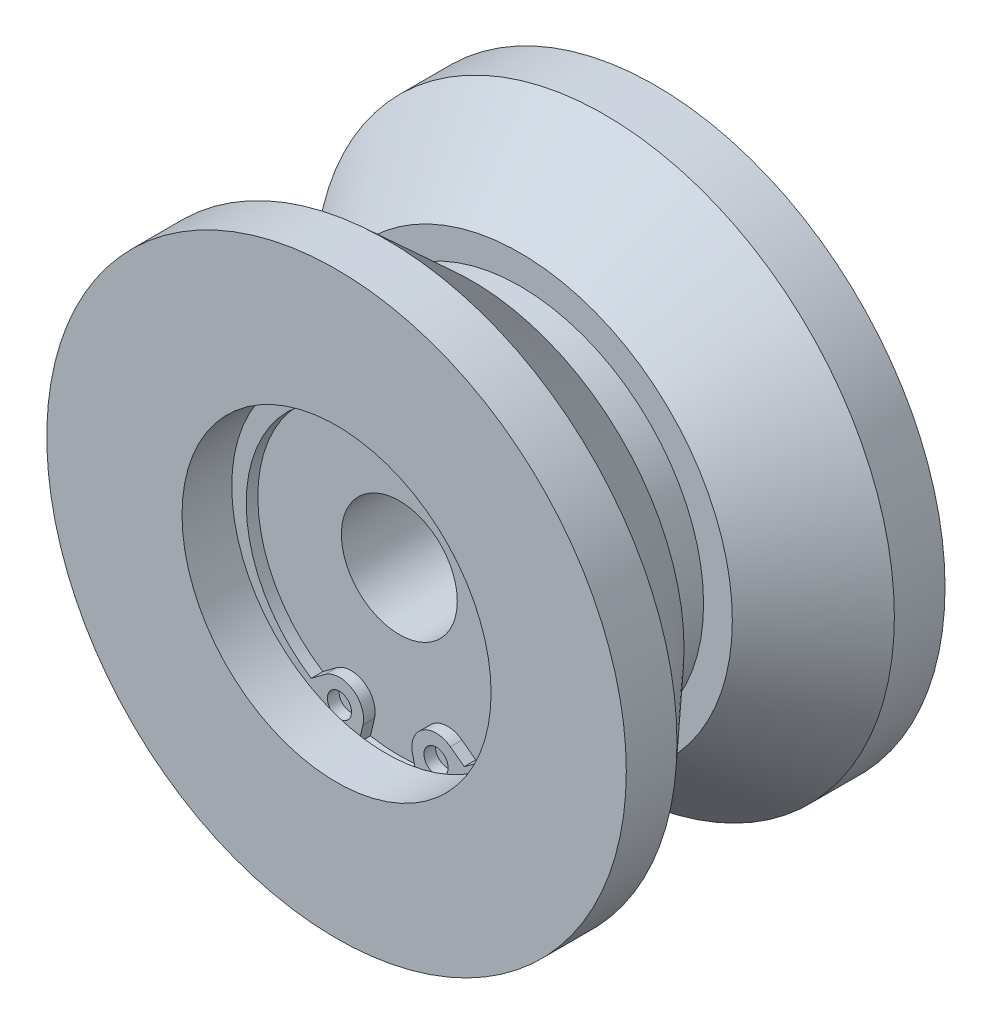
ISO-10303-21;
HEADER;
FILE_DESCRIPTION(('STEP AP214'),'2;1');
FILE_NAME('part.step','',(''),(''),'','','');
FILE_SCHEMA(('AUTOMOTIVE_DESIGN { 1 0 10303 214 1 1 1 1 }'));
ENDSEC;
DATA;
#1=APPLICATION_CONTEXT('core data for automotive mechanical design processes');
#2=APPLICATION_PROTOCOL_DEFINITION('international standard','automotive_design',2000,#1);
#3=PRODUCT_CONTEXT('',#1,'mechanical');
#4=PRODUCT('Part','Part','',(#3));
#5=PRODUCT_RELATED_PRODUCT_CATEGORY('part','',(#4));
#6=PRODUCT_DEFINITION_FORMATION('','',#4);
#7=PRODUCT_DEFINITION_CONTEXT('part definition',#1,'design');
#8=PRODUCT_DEFINITION('design','',#6,#7);
#9=PRODUCT_DEFINITION_SHAPE('','',#8);
#10=(LENGTH_UNIT() NAMED_UNIT(*) SI_UNIT(.MILLI.,.METRE.));
#11=(NAMED_UNIT(*) PLANE_ANGLE_UNIT() SI_UNIT($,.RADIAN.));
#12=(NAMED_UNIT(*) SI_UNIT($,.STERADIAN.) SOLID_ANGLE_UNIT());
#13=UNCERTAINTY_MEASURE_WITH_UNIT(LENGTH_MEASURE(1.E-05),#10,'distance_accuracy_value','');
#14=(GEOMETRIC_REPRESENTATION_CONTEXT(3) GLOBAL_UNCERTAINTY_ASSIGNED_CONTEXT((#13)) GLOBAL_UNIT_ASSIGNED_CONTEXT((#10,
#11,#12)) REPRESENTATION_CONTEXT('',''));
#15=CARTESIAN_POINT('',(0.,0.,0.));
#16=DIRECTION('',(0.,0.,1.));
#17=DIRECTION('',(1.,0.,0.));
#18=AXIS2_PLACEMENT_3D('',#15,#16,#17);
#19=CARTESIAN_POINT('',(0.,16.,10.));
#20=DIRECTION('',(0.,0.,-1.));
#21=DIRECTION('',(-1.,0.,0.));
#22=AXIS2_PLACEMENT_3D('',#19,#20,#21);
#23=PLANE('',#22);
#24=CARTESIAN_POINT('',(5.,-14.2233767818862,10.));
#25=DIRECTION('',(0.,0.,1.));
#26=DIRECTION('',(1.,0.,0.));
#27=AXIS2_PLACEMENT_3D('',#24,#25,#26);
#28=CIRCLE('',#27,1.25);
#29=CARTESIAN_POINT('',(6.25,-14.2233767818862,10.));
#30=VERTEX_POINT('',#29);
#31=EDGE_CURVE('E117',#30,#30,#28,.T.);
#32=ORIENTED_EDGE('',*,*,#31,.T.);
#33=EDGE_LOOP('',(#32));
#34=FACE_BOUND('',#33,.T.);
#35=ADVANCED_FACE('F14',(#34),#23,.F.);
#36=CARTESIAN_POINT('',(-5.,-14.2233767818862,10.));
#37=DIRECTION('',(0.,0.,-1.));
#38=DIRECTION('',(1.,0.,0.));
#39=AXIS2_PLACEMENT_3D('',#36,#37,#38);
#40=CIRCLE('',#39,1.25);
#41=CARTESIAN_POINT('',(-3.75,-14.2233767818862,10.));
#42=VERTEX_POINT('',#41);
#43=EDGE_CURVE('E143',#42,#42,#40,.T.);
#44=ORIENTED_EDGE('',*,*,#43,.F.);
#45=EDGE_LOOP('',(#44));
#46=FACE_BOUND('',#45,.T.);
#47=ADVANCED_FACE('F249',(#46),#23,.F.);
#48=CARTESIAN_POINT('',(0.,0.,21.5));
#49=DIRECTION('',(0.,0.,1.));
#50=DIRECTION('',(1.,0.,0.));
#51=AXIS2_PLACEMENT_3D('',#48,#49,#50);
#52=CYLINDRICAL_SURFACE('',#51,19.);
#53=CARTESIAN_POINT('',(0.,0.,2.5));
#54=DIRECTION('',(0.,0.,1.));
#55=DIRECTION('',(1.,0.,0.));
#56=AXIS2_PLACEMENT_3D('',#53,#54,#55);
#57=CIRCLE('',#56,19.);
#58=CARTESIAN_POINT('',(19.,0.,2.5));
#59=VERTEX_POINT('',#58);
#60=EDGE_CURVE('E198',#59,#59,#57,.T.);
#61=ORIENTED_EDGE('',*,*,#60,.F.);
#62=EDGE_LOOP('',(#61));
#63=FACE_BOUND('',#62,.T.);
#64=CARTESIAN_POINT('',(0.,0.,-2.5));
#65=DIRECTION('',(0.,0.,1.));
#66=DIRECTION('',(1.,0.,0.));
#67=AXIS2_PLACEMENT_3D('',#64,#65,#66);
#68=CIRCLE('',#67,19.0000000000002);
#69=CARTESIAN_POINT('',(19.0000000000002,0.,-2.5));
#70=VERTEX_POINT('',#69);
#71=EDGE_CURVE('E195',#70,#70,#68,.T.);
#72=ORIENTED_EDGE('',*,*,#71,.T.);
#73=EDGE_LOOP('',(#72));
#74=FACE_BOUND('',#73,.T.);
#75=ADVANCED_FACE('F257',(#63,#74),#52,.T.);
#76=CARTESIAN_POINT('',(0.,21.9780763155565,-2.5));
#77=DIRECTION('',(0.,0.,-1.));
#78=DIRECTION('',(-1.,0.,0.));
#79=AXIS2_PLACEMENT_3D('',#76,#77,#78);
#80=PLANE('',#79);
#81=ORIENTED_EDGE('',*,*,#71,.F.);
#82=EDGE_LOOP('',(#81));
#83=FACE_BOUND('',#82,.T.);
#84=CARTESIAN_POINT('',(0.,0.,-2.5));
#85=DIRECTION('',(0.,0.,1.));
#86=DIRECTION('',(1.,0.,0.));
#87=AXIS2_PLACEMENT_3D('',#84,#85,#86);
#88=CIRCLE('',#87,21.9780763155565);
#89=CARTESIAN_POINT('',(21.9780763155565,0.,-2.5));
#90=VERTEX_POINT('',#89);
#91=EDGE_CURVE('E192',#90,#90,#88,.T.);
#92=ORIENTED_EDGE('',*,*,#91,.T.);
#93=EDGE_LOOP('',(#92));
#94=FACE_BOUND('',#93,.T.);
#95=ADVANCED_FACE('F493',(#83,#94),#80,.F.);
#96=CARTESIAN_POINT('',(0.,21.9780763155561,2.5));
#97=DIRECTION('',(0.,0.,1.));
#98=DIRECTION('',(1.,0.,0.));
#99=AXIS2_PLACEMENT_3D('',#96,#97,#98);
#100=PLANE('',#99);
#101=CARTESIAN_POINT('',(0.,0.,2.5));
#102=DIRECTION('',(0.,0.,1.));
#103=DIRECTION('',(1.,0.,0.));
#104=AXIS2_PLACEMENT_3D('',#101,#102,#103);
#105=CIRCLE('',#104,21.9780763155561);
#106=CARTESIAN_POINT('',(21.9780763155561,0.,2.5));
#107=VERTEX_POINT('',#106);
#108=EDGE_CURVE('E201',#107,#107,#105,.T.);
#109=ORIENTED_EDGE('',*,*,#108,.F.);
#110=EDGE_LOOP('',(#109));
#111=FACE_BOUND('',#110,.T.);
#112=ORIENTED_EDGE('',*,*,#60,.T.);
#113=EDGE_LOOP('',(#112));
#114=FACE_BOUND('',#113,.T.);
#115=ADVANCED_FACE('F483',(#111,#114),#100,.F.);
#116=CARTESIAN_POINT('',(0.,0.,-11.2543935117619));
#117=DIRECTION('',(0.,0.,-1.));
#118=DIRECTION('',(-1.,0.,0.));
#119=AXIS2_PLACEMENT_3D('',#116,#117,#118);
#120=CONICAL_SURFACE('',#119,30.,0.741764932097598);
#121=ORIENTED_EDGE('',*,*,#91,.F.);
#122=EDGE_LOOP('',(#121));
#123=FACE_BOUND('',#122,.T.);
#124=CARTESIAN_POINT('',(0.,0.,-11.2543935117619));
#125=DIRECTION('',(0.,0.,1.));
#126=DIRECTION('',(1.,0.,0.));
#127=AXIS2_PLACEMENT_3D('',#124,#125,#126);
#128=CIRCLE('',#127,30.);
#129=CARTESIAN_POINT('',(30.,0.,-11.2543935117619));
#130=VERTEX_POINT('',#129);
#131=EDGE_CURVE('E189',#130,#130,#128,.T.);
#132=ORIENTED_EDGE('',*,*,#131,.T.);
#133=EDGE_LOOP('',(#132));
#134=FACE_BOUND('',#133,.T.);
#135=ADVANCED_FACE('F473',(#123,#134),#120,.T.);
#136=CARTESIAN_POINT('',(0.,0.,2.5));
#137=DIRECTION('',(0.,0.,1.));
#138=DIRECTION('',(1.,0.,0.));
#139=AXIS2_PLACEMENT_3D('',#136,#137,#138);
#140=CONICAL_SURFACE('',#139,21.9780763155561,0.741764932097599);
#141=CARTESIAN_POINT('',(0.,0.,11.2543935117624));
#142=DIRECTION('',(0.,0.,1.));
#143=DIRECTION('',(1.,0.,0.));
#144=AXIS2_PLACEMENT_3D('',#141,#142,#143);
#145=CIRCLE('',#144,30.);
#146=CARTESIAN_POINT('',(30.,0.,11.2543935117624));
#147=VERTEX_POINT('',#146);
#148=EDGE_CURVE('E204',#147,#147,#145,.T.);
#149=ORIENTED_EDGE('',*,*,#148,.F.);
#150=EDGE_LOOP('',(#149));
#151=FACE_BOUND('',#150,.T.);
#152=ORIENTED_EDGE('',*,*,#108,.T.);
#153=EDGE_LOOP('',(#152));
#154=FACE_BOUND('',#153,.T.);
#155=ADVANCED_FACE('F463',(#151,#154),#140,.T.);
#156=CARTESIAN_POINT('',(0.,0.,21.5));
#157=DIRECTION('',(0.,0.,1.));
#158=DIRECTION('',(1.,0.,0.));
#159=AXIS2_PLACEMENT_3D('',#156,#157,#158);
#160=CYLINDRICAL_SURFACE('',#159,30.);
#161=ORIENTED_EDGE('',*,*,#131,.F.);
#162=EDGE_LOOP('',(#161));
#163=FACE_BOUND('',#162,.T.);
#164=CARTESIAN_POINT('',(0.,0.,-16.5));
#165=DIRECTION('',(0.,0.,1.));
#166=DIRECTION('',(1.,0.,0.));
#167=AXIS2_PLACEMENT_3D('',#164,#165,#166);
#168=CIRCLE('',#167,30.);
#169=CARTESIAN_POINT('',(30.,0.,-16.5));
#170=VERTEX_POINT('',#169);
#171=EDGE_CURVE('E186',#170,#170,#168,.T.);
#172=ORIENTED_EDGE('',*,*,#171,.T.);
#173=EDGE_LOOP('',(#172));
#174=FACE_BOUND('',#173,.T.);
#175=ADVANCED_FACE('F453',(#163,#174),#160,.T.);
#176=CARTESIAN_POINT('',(0.,0.,21.5));
#177=DIRECTION('',(0.,0.,1.));
#178=DIRECTION('',(1.,0.,0.));
#179=AXIS2_PLACEMENT_3D('',#176,#177,#178);
#180=CYLINDRICAL_SURFACE('',#179,30.);
#181=CARTESIAN_POINT('',(0.,0.,16.5));
#182=DIRECTION('',(0.,0.,1.));
#183=DIRECTION('',(1.,0.,0.));
#184=AXIS2_PLACEMENT_3D('',#181,#182,#183);
#185=CIRCLE('',#184,30.);
#186=CARTESIAN_POINT('',(30.,0.,16.5));
#187=VERTEX_POINT('',#186);
#188=EDGE_CURVE('E207',#187,#187,#185,.T.);
#189=ORIENTED_EDGE('',*,*,#188,.F.);
#190=EDGE_LOOP('',(#189));
#191=FACE_BOUND('',#190,.T.);
#192=ORIENTED_EDGE('',*,*,#148,.T.);
#193=EDGE_LOOP('',(#192));
#194=FACE_BOUND('',#193,.T.);
#195=ADVANCED_FACE('F444',(#191,#194),#180,.T.);
#196=CARTESIAN_POINT('',(0.,30.,-16.5));
#197=DIRECTION('',(0.,0.,1.));
#198=DIRECTION('',(1.,0.,0.));
#199=AXIS2_PLACEMENT_3D('',#196,#197,#198);
#200=PLANE('',#199);
#201=ORIENTED_EDGE('',*,*,#171,.F.);
#202=EDGE_LOOP('',(#201));
#203=FACE_BOUND('',#202,.T.);
#204=CARTESIAN_POINT('',(0.,0.,-16.5));
#205=DIRECTION('',(0.,0.,1.));
#206=DIRECTION('',(1.,0.,0.));
#207=AXIS2_PLACEMENT_3D('',#204,#205,#206);
#208=CIRCLE('',#207,13.);
#209=CARTESIAN_POINT('',(13.,0.,-16.5));
#210=VERTEX_POINT('',#209);
#211=EDGE_CURVE('E144',#210,#210,#208,.T.);
#212=ORIENTED_EDGE('',*,*,#211,.T.);
#213=EDGE_LOOP('',(#212));
#214=FACE_BOUND('',#213,.T.);
#215=ADVANCED_FACE('F16',(#203,#214),#200,.F.);
#216=CARTESIAN_POINT('',(0.,30.,16.5));
#217=DIRECTION('',(0.,0.,-1.));
#218=DIRECTION('',(-1.,0.,0.));
#219=AXIS2_PLACEMENT_3D('',#216,#217,#218);
#220=PLANE('',#219);
#221=CARTESIAN_POINT('',(0.,0.,16.5));
#222=DIRECTION('',(0.,0.,1.));
#223=DIRECTION('',(1.,0.,0.));
#224=AXIS2_PLACEMENT_3D('',#221,#222,#223);
#225=CIRCLE('',#224,16.);
#226=CARTESIAN_POINT('',(16.,0.,16.5));
#227=VERTEX_POINT('',#226);
#228=EDGE_CURVE('E210',#227,#227,#225,.T.);
#229=ORIENTED_EDGE('',*,*,#228,.F.);
#230=EDGE_LOOP('',(#229));
#231=FACE_BOUND('',#230,.T.);
#232=ORIENTED_EDGE('',*,*,#188,.T.);
#233=EDGE_LOOP('',(#232));
#234=FACE_BOUND('',#233,.T.);
#235=ADVANCED_FACE('F426',(#231,#234),#220,.F.);
#236=CARTESIAN_POINT('',(0.,0.,21.5));
#237=DIRECTION('',(0.,0.,1.));
#238=DIRECTION('',(1.,0.,0.));
#239=AXIS2_PLACEMENT_3D('',#236,#237,#238);
#240=CYLINDRICAL_SURFACE('',#239,13.);
#241=ORIENTED_EDGE('',*,*,#211,.F.);
#242=EDGE_LOOP('',(#241));
#243=FACE_BOUND('',#242,.T.);
#244=CARTESIAN_POINT('',(0.,0.,-10.));
#245=DIRECTION('',(0.,0.,1.));
#246=DIRECTION('',(1.,0.,0.));
#247=AXIS2_PLACEMENT_3D('',#244,#245,#246);
#248=CIRCLE('',#247,13.);
#249=CARTESIAN_POINT('',(13.,0.,-10.));
#250=VERTEX_POINT('',#249);
#251=EDGE_CURVE('E219',#250,#250,#248,.T.);
#252=ORIENTED_EDGE('',*,*,#251,.T.);
#253=EDGE_LOOP('',(#252));
#254=FACE_BOUND('',#253,.T.);
#255=ADVANCED_FACE('F418',(#243,#254),#240,.F.);
#256=CARTESIAN_POINT('',(0.,0.,21.5));
#257=DIRECTION('',(0.,0.,1.));
#258=DIRECTION('',(1.,0.,0.));
#259=AXIS2_PLACEMENT_3D('',#256,#257,#258);
#260=CYLINDRICAL_SURFACE('',#259,16.);
#261=CARTESIAN_POINT('',(0.,0.,11.35));
#262=DIRECTION('',(0.,0.,1.));
#263=DIRECTION('',(1.,0.,0.));
#264=AXIS2_PLACEMENT_3D('',#261,#262,#263);
#265=CIRCLE('',#264,16.);
#266=CARTESIAN_POINT('',(16.,0.,11.35));
#267=VERTEX_POINT('',#266);
#268=EDGE_CURVE('E182',#267,#267,#265,.F.);
#269=ORIENTED_EDGE('',*,*,#268,.T.);
#270=EDGE_LOOP('',(#269));
#271=FACE_BOUND('',#270,.T.);
#272=ORIENTED_EDGE('',*,*,#228,.T.);
#273=EDGE_LOOP('',(#272));
#274=FACE_BOUND('',#273,.T.);
#275=ADVANCED_FACE('F227',(#271,#274),#260,.F.);
#276=CARTESIAN_POINT('',(0.,13.,-10.));
#277=DIRECTION('',(0.,0.,1.));
#278=DIRECTION('',(1.,0.,0.));
#279=AXIS2_PLACEMENT_3D('',#276,#277,#278);
#280=PLANE('',#279);
#281=ORIENTED_EDGE('',*,*,#251,.F.);
#282=EDGE_LOOP('',(#281));
#283=FACE_BOUND('',#282,.T.);
#284=CARTESIAN_POINT('',(0.,0.,-10.));
#285=DIRECTION('',(0.,0.,1.));
#286=DIRECTION('',(1.,0.,0.));
#287=AXIS2_PLACEMENT_3D('',#284,#285,#286);
#288=CIRCLE('',#287,5.99999999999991);
#289=CARTESIAN_POINT('',(5.99999999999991,0.,-10.));
#290=VERTEX_POINT('',#289);
#291=EDGE_CURVE('E216',#290,#290,#288,.T.);
#292=ORIENTED_EDGE('',*,*,#291,.T.);
#293=EDGE_LOOP('',(#292));
#294=FACE_BOUND('',#293,.T.);
#295=ADVANCED_FACE('F233',(#283,#294),#280,.F.);
#296=CARTESIAN_POINT('',(0.,0.,11.35));
#297=DIRECTION('',(0.,0.,1.));
#298=DIRECTION('',(1.,0.,0.));
#299=AXIS2_PLACEMENT_3D('',#296,#297,#298);
#300=PLANE('',#299);
#301=CARTESIAN_POINT('',(0.,0.,11.35));
#302=DIRECTION('',(0.,0.,1.));
#303=DIRECTION('',(1.,0.,0.));
#304=AXIS2_PLACEMENT_3D('',#301,#302,#303);
#305=CIRCLE('',#304,16.85);
#306=CARTESIAN_POINT('',(16.85,0.,11.35));
#307=VERTEX_POINT('',#306);
#308=EDGE_CURVE('E179',#307,#307,#305,.T.);
#309=ORIENTED_EDGE('',*,*,#308,.F.);
#310=EDGE_LOOP('',(#309));
#311=FACE_BOUND('',#310,.T.);
#312=ORIENTED_EDGE('',*,*,#268,.F.);
#313=EDGE_LOOP('',(#312));
#314=FACE_BOUND('',#313,.T.);
#315=ADVANCED_FACE('F230',(#311,#314),#300,.F.);
#316=CARTESIAN_POINT('',(0.,0.,11.35));
#317=DIRECTION('',(0.,0.,-1.));
#318=DIRECTION('',(-1.,0.,0.));
#319=AXIS2_PLACEMENT_3D('',#316,#317,#318);
#320=CYLINDRICAL_SURFACE('',#319,16.85);
#321=ORIENTED_EDGE('',*,*,#308,.T.);
#322=EDGE_LOOP('',(#321));
#323=FACE_BOUND('',#322,.T.);
#324=DIRECTION('',(0.,0.,-1.));
#325=VECTOR('',#324,1.);
#326=CARTESIAN_POINT('',(2.99125499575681,-16.5823669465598,11.35));
#327=LINE('',#326,#325);
#328=CARTESIAN_POINT('',(2.99125499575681,-16.5823669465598,10.));
#329=VERTEX_POINT('',#328);
#330=CARTESIAN_POINT('',(2.99125499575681,-16.5823669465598,11.2));
#331=VERTEX_POINT('',#330);
#332=EDGE_CURVE('E18',#329,#331,#327,.F.);
#333=ORIENTED_EDGE('',*,*,#332,.F.);
#334=CARTESIAN_POINT('',(0.,0.,10.));
#335=DIRECTION('',(0.,0.,1.));
#336=DIRECTION('',(1.,0.,0.));
#337=AXIS2_PLACEMENT_3D('',#334,#335,#336);
#338=CIRCLE('',#337,16.85);
#339=CARTESIAN_POINT('',(-2.99125499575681,-16.5823669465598,10.));
#340=VERTEX_POINT('',#339);
#341=EDGE_CURVE('E183',#340,#329,#338,.T.);
#342=ORIENTED_EDGE('',*,*,#341,.F.);
#343=DIRECTION('',(0.,0.,-1.));
#344=VECTOR('',#343,1.);
#345=CARTESIAN_POINT('',(-2.99125499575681,-16.5823669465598,11.35));
#346=LINE('',#345,#344);
#347=CARTESIAN_POINT('',(-2.99125499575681,-16.5823669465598,11.2));
#348=VERTEX_POINT('',#347);
#349=EDGE_CURVE('E176',#348,#340,#346,.T.);
#350=ORIENTED_EDGE('',*,*,#349,.F.);
#351=CARTESIAN_POINT('',(0.,0.,11.2));
#352=DIRECTION('',(0.,0.,-1.));
#353=DIRECTION('',(-1.,0.,0.));
#354=AXIS2_PLACEMENT_3D('',#351,#352,#353);
#355=CIRCLE('',#354,16.85);
#356=EDGE_CURVE('E9',#331,#348,#355,.F.);
#357=ORIENTED_EDGE('',*,*,#356,.F.);
#358=EDGE_LOOP('',(#333,#342,#350,#357));
#359=FACE_BOUND('',#358,.T.);
#360=ADVANCED_FACE('F232',(#323,#359),#320,.F.);
#361=CARTESIAN_POINT('',(0.,0.,21.5));
#362=DIRECTION('',(0.,0.,1.));
#363=DIRECTION('',(1.,0.,0.));
#364=AXIS2_PLACEMENT_3D('',#361,#362,#363);
#365=CYLINDRICAL_SURFACE('',#364,5.99999999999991);
#366=ORIENTED_EDGE('',*,*,#291,.F.);
#367=EDGE_LOOP('',(#366));
#368=FACE_BOUND('',#367,.T.);
#369=CARTESIAN_POINT('',(0.,0.,10.));
#370=DIRECTION('',(0.,0.,1.));
#371=DIRECTION('',(1.,0.,0.));
#372=AXIS2_PLACEMENT_3D('',#369,#370,#371);
#373=CIRCLE('',#372,5.99999999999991);
#374=CARTESIAN_POINT('',(5.99999999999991,0.,10.));
#375=VERTEX_POINT('',#374);
#376=EDGE_CURVE('E213',#375,#375,#373,.T.);
#377=ORIENTED_EDGE('',*,*,#376,.T.);
#378=EDGE_LOOP('',(#377));
#379=FACE_BOUND('',#378,.T.);
#380=ADVANCED_FACE('F241',(#368,#379),#365,.F.);
#381=ORIENTED_EDGE('',*,*,#376,.F.);
#382=EDGE_LOOP('',(#381));
#383=FACE_BOUND('',#382,.T.);
#384=ORIENTED_EDGE('',*,*,#341,.T.);
#385=DIRECTION('',(0.231349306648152,-0.972870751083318,0.));
#386=VECTOR('',#385,1.);
#387=CARTESIAN_POINT('',(2.5678231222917,-14.8017500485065,10.));
#388=LINE('',#387,#386);
#389=CARTESIAN_POINT('',(2.5678231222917,-14.8017500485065,10.));
#390=VERTEX_POINT('',#389);
#391=EDGE_CURVE('E34',#390,#329,#388,.T.);
#392=ORIENTED_EDGE('',*,*,#391,.F.);
#393=CARTESIAN_POINT('',(5.,-14.2233767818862,10.));
#394=DIRECTION('',(0.,0.,1.));
#395=DIRECTION('',(1.,0.,0.));
#396=AXIS2_PLACEMENT_3D('',#393,#394,#395);
#397=CIRCLE('',#396,2.5);
#398=CARTESIAN_POINT('',(6.49138441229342,-12.2169439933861,10.));
#399=VERTEX_POINT('',#398);
#400=EDGE_CURVE('E134',#399,#390,#397,.T.);
#401=ORIENTED_EDGE('',*,*,#400,.F.);
#402=DIRECTION('',(-0.802573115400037,0.596553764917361,0.));
#403=VECTOR('',#402,1.);
#404=CARTESIAN_POINT('',(6.49138441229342,-12.2169439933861,10.));
#405=LINE('',#404,#403);
#406=CARTESIAN_POINT('',(7.91695293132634,-13.2765711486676,10.));
#407=VERTEX_POINT('',#406);
#408=EDGE_CURVE('E148',#407,#399,#405,.T.);
#409=ORIENTED_EDGE('',*,*,#408,.F.);
#410=CARTESIAN_POINT('',(0.,-0.95,10.));
#411=DIRECTION('',(0.,0.,-1.));
#412=DIRECTION('',(0.,-1.,0.));
#413=AXIS2_PLACEMENT_3D('',#410,#411,#412);
#414=CIRCLE('',#413,14.65);
#415=CARTESIAN_POINT('',(-7.91695293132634,-13.2765711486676,10.));
#416=VERTEX_POINT('',#415);
#417=EDGE_CURVE('E163',#416,#407,#414,.T.);
#418=ORIENTED_EDGE('',*,*,#417,.F.);
#419=DIRECTION('',(-0.802573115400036,-0.596553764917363,0.));
#420=VECTOR('',#419,1.);
#421=CARTESIAN_POINT('',(-6.49138441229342,-12.2169439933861,10.));
#422=LINE('',#421,#420);
#423=CARTESIAN_POINT('',(-6.49138441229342,-12.2169439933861,10.));
#424=VERTEX_POINT('',#423);
#425=EDGE_CURVE('E116',#424,#416,#422,.T.);
#426=ORIENTED_EDGE('',*,*,#425,.F.);
#427=CARTESIAN_POINT('',(-5.,-14.2233767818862,10.));
#428=DIRECTION('',(0.,0.,1.));
#429=DIRECTION('',(-1.,0.,0.));
#430=AXIS2_PLACEMENT_3D('',#427,#428,#429);
#431=CIRCLE('',#430,2.5);
#432=CARTESIAN_POINT('',(-2.56782312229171,-14.8017500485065,10.));
#433=VERTEX_POINT('',#432);
#434=EDGE_CURVE('E113',#433,#424,#431,.T.);
#435=ORIENTED_EDGE('',*,*,#434,.F.);
#436=DIRECTION('',(0.231349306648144,0.97287075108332,0.));
#437=VECTOR('',#436,1.);
#438=CARTESIAN_POINT('',(-2.56782312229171,-14.8017500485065,10.));
#439=LINE('',#438,#437);
#440=EDGE_CURVE('E155',#340,#433,#439,.T.);
#441=ORIENTED_EDGE('',*,*,#440,.F.);
#442=EDGE_LOOP('',(#384,#392,#401,#409,#418,#426,#435,#441));
#443=FACE_BOUND('',#442,.T.);
#444=ADVANCED_FACE('F252',(#383,#443),#23,.F.);
#445=CARTESIAN_POINT('',(0.,-0.95,11.2));
#446=DIRECTION('',(0.,0.,1.));
#447=DIRECTION('',(-1.,0.,0.));
#448=AXIS2_PLACEMENT_3D('',#445,#446,#447);
#449=CYLINDRICAL_SURFACE('',#448,14.65);
#450=ORIENTED_EDGE('',*,*,#417,.T.);
#451=DIRECTION('',(0.,0.,-1.));
#452=VECTOR('',#451,1.);
#453=CARTESIAN_POINT('',(7.91695293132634,-13.2765711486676,11.2));
#454=LINE('',#453,#452);
#455=CARTESIAN_POINT('',(7.91695293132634,-13.2765711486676,11.2));
#456=VERTEX_POINT('',#455);
#457=EDGE_CURVE('E103',#456,#407,#454,.T.);
#458=ORIENTED_EDGE('',*,*,#457,.F.);
#459=CARTESIAN_POINT('',(0.,-0.95,11.2));
#460=DIRECTION('',(0.,0.,-1.));
#461=DIRECTION('',(0.,-1.,0.));
#462=AXIS2_PLACEMENT_3D('',#459,#460,#461);
#463=CIRCLE('',#462,14.65);
#464=CARTESIAN_POINT('',(-7.91695293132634,-13.2765711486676,11.2));
#465=VERTEX_POINT('',#464);
#466=EDGE_CURVE('E104',#465,#456,#463,.T.);
#467=ORIENTED_EDGE('',*,*,#466,.F.);
#468=DIRECTION('',(0.,0.,-1.));
#469=VECTOR('',#468,1.);
#470=CARTESIAN_POINT('',(-7.91695293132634,-13.2765711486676,11.2));
#471=LINE('',#470,#469);
#472=EDGE_CURVE('E98',#465,#416,#471,.T.);
#473=ORIENTED_EDGE('',*,*,#472,.T.);
#474=EDGE_LOOP('',(#450,#458,#467,#473));
#475=FACE_BOUND('',#474,.T.);
#476=ADVANCED_FACE('F253',(#475),#449,.F.);
#477=CARTESIAN_POINT('',(6.49138441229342,-12.2169439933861,11.2));
#478=DIRECTION('',(-0.596553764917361,-0.802573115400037,0.));
#479=DIRECTION('',(-0.802573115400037,0.596553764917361,0.));
#480=AXIS2_PLACEMENT_3D('',#477,#478,#479);
#481=PLANE('',#480);
#482=ORIENTED_EDGE('',*,*,#408,.T.);
#483=DIRECTION('',(0.,0.,-1.));
#484=VECTOR('',#483,1.);
#485=CARTESIAN_POINT('',(6.49138441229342,-12.2169439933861,11.2));
#486=LINE('',#485,#484);
#487=CARTESIAN_POINT('',(6.49138441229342,-12.2169439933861,11.2));
#488=VERTEX_POINT('',#487);
#489=EDGE_CURVE('E153',#488,#399,#486,.T.);
#490=ORIENTED_EDGE('',*,*,#489,.F.);
#491=DIRECTION('',(-0.802573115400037,0.596553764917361,0.));
#492=VECTOR('',#491,1.);
#493=CARTESIAN_POINT('',(6.49138441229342,-12.2169439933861,11.2));
#494=LINE('',#493,#492);
#495=EDGE_CURVE('E138',#456,#488,#494,.T.);
#496=ORIENTED_EDGE('',*,*,#495,.F.);
#497=ORIENTED_EDGE('',*,*,#457,.T.);
#498=EDGE_LOOP('',(#482,#490,#496,#497));
#499=FACE_BOUND('',#498,.T.);
#500=ADVANCED_FACE('F265',(#499),#481,.F.);
#501=CARTESIAN_POINT('',(5.,-14.2233767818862,11.2));
#502=DIRECTION('',(0.,0.,1.));
#503=DIRECTION('',(-1.,0.,0.));
#504=AXIS2_PLACEMENT_3D('',#501,#502,#503);
#505=CYLINDRICAL_SURFACE('',#504,2.5);
#506=ORIENTED_EDGE('',*,*,#400,.T.);
#507=DIRECTION('',(0.,0.,-1.));
#508=VECTOR('',#507,1.);
#509=CARTESIAN_POINT('',(2.5678231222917,-14.8017500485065,11.2));
#510=LINE('',#509,#508);
#511=CARTESIAN_POINT('',(2.5678231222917,-14.8017500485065,11.2));
#512=VERTEX_POINT('',#511);
#513=EDGE_CURVE('E154',#512,#390,#510,.T.);
#514=ORIENTED_EDGE('',*,*,#513,.F.);
#515=CARTESIAN_POINT('',(5.,-14.2233767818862,11.2));
#516=DIRECTION('',(0.,0.,1.));
#517=DIRECTION('',(1.,0.,0.));
#518=AXIS2_PLACEMENT_3D('',#515,#516,#517);
#519=CIRCLE('',#518,2.5);
#520=EDGE_CURVE('E167',#488,#512,#519,.T.);
#521=ORIENTED_EDGE('',*,*,#520,.F.);
#522=ORIENTED_EDGE('',*,*,#489,.T.);
#523=EDGE_LOOP('',(#506,#514,#521,#522));
#524=FACE_BOUND('',#523,.T.);
#525=ADVANCED_FACE('F271',(#524),#505,.T.);
#526=CARTESIAN_POINT('',(-2.56782312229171,-14.8017500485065,11.2));
#527=DIRECTION('',(-0.97287075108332,0.231349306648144,0.));
#528=DIRECTION('',(0.,0.,1.));
#529=AXIS2_PLACEMENT_3D('',#526,#527,#528);
#530=PLANE('',#529);
#531=DIRECTION('',(0.231349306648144,0.97287075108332,0.));
#532=VECTOR('',#531,1.);
#533=CARTESIAN_POINT('',(-2.56782312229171,-14.8017500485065,11.2));
#534=LINE('',#533,#532);
#535=CARTESIAN_POINT('',(-2.56782312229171,-14.8017500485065,11.2));
#536=VERTEX_POINT('',#535);
#537=EDGE_CURVE('E122',#348,#536,#534,.T.);
#538=ORIENTED_EDGE('',*,*,#537,.F.);
#539=ORIENTED_EDGE('',*,*,#349,.T.);
#540=ORIENTED_EDGE('',*,*,#440,.T.);
#541=DIRECTION('',(0.,0.,-1.));
#542=VECTOR('',#541,1.);
#543=CARTESIAN_POINT('',(-2.56782312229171,-14.8017500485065,11.2));
#544=LINE('',#543,#542);
#545=EDGE_CURVE('E172',#536,#433,#544,.T.);
#546=ORIENTED_EDGE('',*,*,#545,.F.);
#547=EDGE_LOOP('',(#538,#539,#540,#546));
#548=FACE_BOUND('',#547,.T.);
#549=ADVANCED_FACE('F277',(#548),#530,.F.);
#550=CARTESIAN_POINT('',(0.,-0.95,11.2));
#551=DIRECTION('',(0.,0.,-1.));
#552=DIRECTION('',(0.,-1.,0.));
#553=AXIS2_PLACEMENT_3D('',#550,#551,#552);
#554=PLANE('',#553);
#555=CARTESIAN_POINT('',(-5.,-14.2233767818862,11.2));
#556=DIRECTION('',(0.,0.,-1.));
#557=DIRECTION('',(1.,0.,0.));
#558=AXIS2_PLACEMENT_3D('',#555,#556,#557);
#559=CIRCLE('',#558,1.25);
#560=CARTESIAN_POINT('',(-3.75,-14.2233767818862,11.2));
#561=VERTEX_POINT('',#560);
#562=EDGE_CURVE('E124',#561,#561,#559,.T.);
#563=ORIENTED_EDGE('',*,*,#562,.T.);
#564=EDGE_LOOP('',(#563));
#565=FACE_BOUND('',#564,.T.);
#566=CARTESIAN_POINT('',(5.,-14.2233767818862,11.2));
#567=DIRECTION('',(0.,0.,1.));
#568=DIRECTION('',(1.,0.,0.));
#569=AXIS2_PLACEMENT_3D('',#566,#567,#568);
#570=CIRCLE('',#569,1.25);
#571=CARTESIAN_POINT('',(6.25,-14.2233767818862,11.2));
#572=VERTEX_POINT('',#571);
#573=EDGE_CURVE('E140',#572,#572,#570,.T.);
#574=ORIENTED_EDGE('',*,*,#573,.F.);
#575=EDGE_LOOP('',(#574));
#576=FACE_BOUND('',#575,.T.);
#577=DIRECTION('',(0.231349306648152,-0.972870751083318,0.));
#578=VECTOR('',#577,1.);
#579=CARTESIAN_POINT('',(2.5678231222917,-14.8017500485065,11.2));
#580=LINE('',#579,#578);
#581=EDGE_CURVE('E130',#512,#331,#580,.T.);
#582=ORIENTED_EDGE('',*,*,#581,.T.);
#583=ORIENTED_EDGE('',*,*,#356,.T.);
#584=ORIENTED_EDGE('',*,*,#537,.T.);
#585=CARTESIAN_POINT('',(-5.,-14.2233767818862,11.2));
#586=DIRECTION('',(0.,0.,1.));
#587=DIRECTION('',(-1.,0.,0.));
#588=AXIS2_PLACEMENT_3D('',#585,#586,#587);
#589=CIRCLE('',#588,2.5);
#590=CARTESIAN_POINT('',(-6.49138441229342,-12.2169439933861,11.2));
#591=VERTEX_POINT('',#590);
#592=EDGE_CURVE('E110',#536,#591,#589,.T.);
#593=ORIENTED_EDGE('',*,*,#592,.T.);
#594=DIRECTION('',(-0.802573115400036,-0.596553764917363,0.));
#595=VECTOR('',#594,1.);
#596=CARTESIAN_POINT('',(-6.49138441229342,-12.2169439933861,11.2));
#597=LINE('',#596,#595);
#598=EDGE_CURVE('E93',#591,#465,#597,.T.);
#599=ORIENTED_EDGE('',*,*,#598,.T.);
#600=ORIENTED_EDGE('',*,*,#466,.T.);
#601=ORIENTED_EDGE('',*,*,#495,.T.);
#602=ORIENTED_EDGE('',*,*,#520,.T.);
#603=EDGE_LOOP('',(#582,#583,#584,#593,#599,#600,#601,#602));
#604=FACE_BOUND('',#603,.T.);
#605=ADVANCED_FACE('F120',(#565,#576,#604),#554,.F.);
#606=CARTESIAN_POINT('',(5.,-14.2233767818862,11.2));
#607=DIRECTION('',(0.,0.,1.));
#608=DIRECTION('',(-1.,0.,0.));
#609=AXIS2_PLACEMENT_3D('',#606,#607,#608);
#610=CYLINDRICAL_SURFACE('',#609,1.25);
#611=ORIENTED_EDGE('',*,*,#31,.F.);
#612=EDGE_LOOP('',(#611));
#613=FACE_BOUND('',#612,.T.);
#614=ORIENTED_EDGE('',*,*,#573,.T.);
#615=EDGE_LOOP('',(#614));
#616=FACE_BOUND('',#615,.T.);
#617=ADVANCED_FACE('F330',(#613,#616),#610,.F.);
#618=CARTESIAN_POINT('',(-5.,-14.2233767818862,11.2));
#619=DIRECTION('',(0.,0.,1.));
#620=DIRECTION('',(-1.,0.,0.));
#621=AXIS2_PLACEMENT_3D('',#618,#619,#620);
#622=CYLINDRICAL_SURFACE('',#621,1.25);
#623=ORIENTED_EDGE('',*,*,#43,.T.);
#624=EDGE_LOOP('',(#623));
#625=FACE_BOUND('',#624,.T.);
#626=ORIENTED_EDGE('',*,*,#562,.F.);
#627=EDGE_LOOP('',(#626));
#628=FACE_BOUND('',#627,.T.);
#629=ADVANCED_FACE('F327',(#625,#628),#622,.F.);
#630=CARTESIAN_POINT('',(-6.49138441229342,-12.2169439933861,11.2));
#631=DIRECTION('',(0.596553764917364,-0.802573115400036,0.));
#632=DIRECTION('',(0.,0.,-1.));
#633=AXIS2_PLACEMENT_3D('',#630,#631,#632);
#634=PLANE('',#633);
#635=ORIENTED_EDGE('',*,*,#425,.T.);
#636=ORIENTED_EDGE('',*,*,#472,.F.);
#637=ORIENTED_EDGE('',*,*,#598,.F.);
#638=DIRECTION('',(0.,0.,-1.));
#639=VECTOR('',#638,1.);
#640=CARTESIAN_POINT('',(-6.49138441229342,-12.2169439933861,11.2));
#641=LINE('',#640,#639);
#642=EDGE_CURVE('E96',#591,#424,#641,.T.);
#643=ORIENTED_EDGE('',*,*,#642,.T.);
#644=EDGE_LOOP('',(#635,#636,#637,#643));
#645=FACE_BOUND('',#644,.T.);
#646=ADVANCED_FACE('F95',(#645),#634,.F.);
#647=CARTESIAN_POINT('',(-5.,-14.2233767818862,11.2));
#648=DIRECTION('',(0.,0.,1.));
#649=DIRECTION('',(-1.,0.,0.));
#650=AXIS2_PLACEMENT_3D('',#647,#648,#649);
#651=CYLINDRICAL_SURFACE('',#650,2.5);
#652=ORIENTED_EDGE('',*,*,#434,.T.);
#653=ORIENTED_EDGE('',*,*,#642,.F.);
#654=ORIENTED_EDGE('',*,*,#592,.F.);
#655=ORIENTED_EDGE('',*,*,#545,.T.);
#656=EDGE_LOOP('',(#652,#653,#654,#655));
#657=FACE_BOUND('',#656,.T.);
#658=ADVANCED_FACE('F108',(#657),#651,.T.);
#659=CARTESIAN_POINT('',(2.5678231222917,-14.8017500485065,11.2));
#660=DIRECTION('',(0.972870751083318,0.231349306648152,0.));
#661=DIRECTION('',(0.,0.,-1.));
#662=AXIS2_PLACEMENT_3D('',#659,#660,#661);
#663=PLANE('',#662);
#664=ORIENTED_EDGE('',*,*,#391,.T.);
#665=ORIENTED_EDGE('',*,*,#332,.T.);
#666=ORIENTED_EDGE('',*,*,#581,.F.);
#667=ORIENTED_EDGE('',*,*,#513,.T.);
#668=EDGE_LOOP('',(#664,#665,#666,#667));
#669=FACE_BOUND('',#668,.T.);
#670=ADVANCED_FACE('F259',(#669),#663,.F.);
#671=CLOSED_SHELL('',(#35,#47,#75,#95,#115,#135,#155,#175,#195,#215,#235,#255,#275,#295,#315,
#360,#380,#444,#476,#500,#525,#549,#605,#617,#629,#646,#658,#670));
#672=MANIFOLD_SOLID_BREP('B1',#671);
#673=ADVANCED_BREP_SHAPE_REPRESENTATION('',(#18,#672),#14);
#674=SHAPE_DEFINITION_REPRESENTATION(#9,#673);
ENDSEC;
END-ISO-10303-21;
